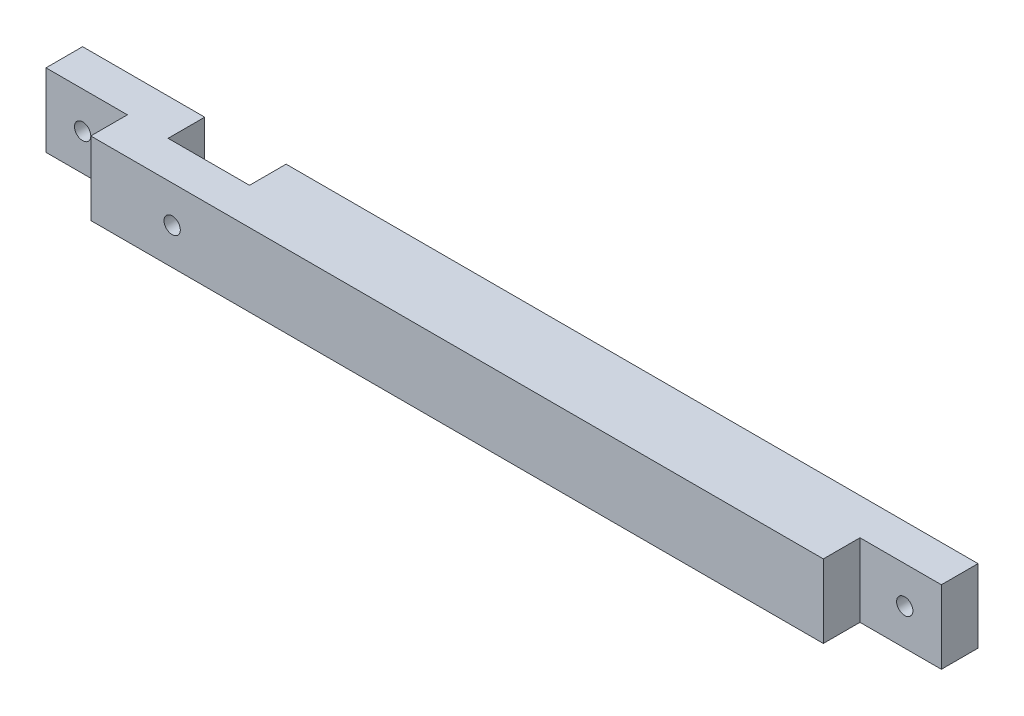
from build123d import *

# Parameters (mm, degrees)
ESQUISSE1_W             = 110
ESQUISSE1_H             = 9
EXTRUSION1_DEPTH        = 9
ESQUISSE2_W             = 10
ESQUISSE2_H             = 9
ENL_V_MAT_EXTRU_1_DEPTH = 4.5
ESQUISSE4_R             = 1
ENL_V_MAT_EXTRU_2_DEPTH = 4.5
ESQUISSE5_R             = 1
ENL_V_MAT_EXTRU_3_DEPTH = 4.5
ESQUISSE6_W             = 10
ESQUISSE6_H             = 9
ENL_V_MAT_EXTRU_4_DEPTH = 4.5
ESQUISSE7_R             = 1
ENL_V_MAT_EXTRU_5_DEPTH = 4.5


with BuildPart() as part:
    # Esquisse1 → Extrusion1 (new body)
    with BuildSketch(Plane.XY):
        with Locations((-12.271684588, -105.117562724)):
            Rectangle(ESQUISSE1_W, ESQUISSE1_H)
    extrude(amount=EXTRUSION1_DEPTH)

    # Esquisse2 → Enl_v. mat.-Extru.1 (cut)
    with BuildSketch(Plane.XY.offset(9)):
        with Locations((-62.271684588, -105.117562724)):
            Rectangle(ESQUISSE2_W, ESQUISSE2_H)
        with Locations((37.728315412, -105.117562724)):
            Rectangle(ESQUISSE2_W, ESQUISSE2_H)
    extrude(amount=-ENL_V_MAT_EXTRU_1_DEPTH, mode=Mode.SUBTRACT)

    # Esquisse4 → Enl_v. mat.-Extru.2 (cut)
    with BuildSketch(Plane.XY.offset(4.5)):
        with Locations((38.22840174, -105.145436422)):
            Circle(ESQUISSE4_R)
    extrude(amount=-ENL_V_MAT_EXTRU_2_DEPTH, mode=Mode.SUBTRACT)

    # Esquisse5 → Enl_v. mat.-Extru.3 (cut)
    with BuildSketch(Plane.XY.offset(4.5)):
        with Locations((-62.771684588, -105.117562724)):
            Circle(ESQUISSE5_R)
    extrude(amount=-ENL_V_MAT_EXTRU_3_DEPTH, mode=Mode.SUBTRACT)

    # Esquisse6 → Enl_v. mat.-Extru.4 (cut)
    with BuildSketch(Plane(origin=(0, 0, 0), x_dir=(-1, 0, 0), z_dir=(0, 0, -1))):
        with Locations((47.271684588, -105.117562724)):
            Rectangle(ESQUISSE6_W, ESQUISSE6_H)
    extrude(amount=-ENL_V_MAT_EXTRU_4_DEPTH, mode=Mode.SUBTRACT)

    # Esquisse7 → Enl_v. mat.-Extru.5 (cut)
    with BuildSketch(Plane(origin=(0, 0, 4.5), x_dir=(-1, 0, 0), z_dir=(0, 0, -1))):
        with Locations((47.271684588, -105.117562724)):
            Circle(ESQUISSE7_R)
    extrude(amount=-ENL_V_MAT_EXTRU_5_DEPTH, mode=Mode.SUBTRACT)


solid = part.part
